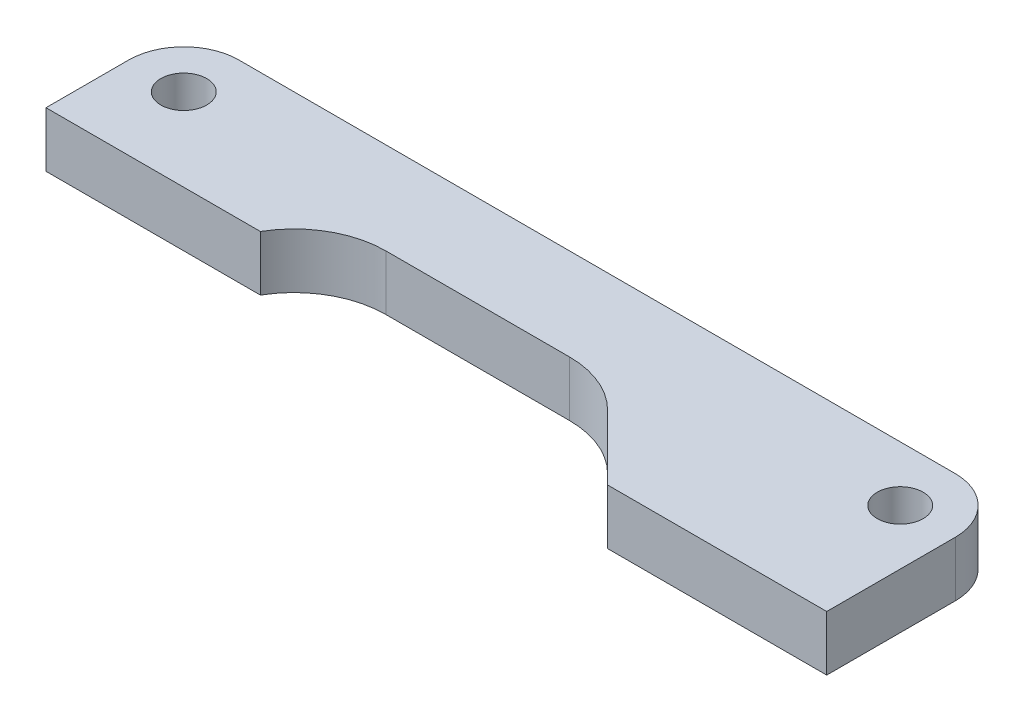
from build123d import *

# Parameters (mm, degrees)
SKETCH1_R      = 2.5
EXTRUDE1_DEPTH = 6


with BuildPart() as part:
    # Sketch1 → Extrude1 (new body)
    with BuildSketch(Plane(origin=(0, 0, 0), x_dir=(1, 0, 0), z_dir=(0, 1, 0))):
        with BuildLine():
            Line((0, 5), (0, 14))
            ThreePointArc((0, 14), (1.757359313, 18.242640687), (6, 20))
            Line((6, 20), (84, 20))
            ThreePointArc((84, 20), (88.242640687, 18.242640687), (90, 14))
            Line((90, 14), (90, 0))
            Line((90, 0), (66.142135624, 0))
            Line((66.142135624, 0), (59.071067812, 7.071067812))
            ThreePointArc((59.071067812, 7.071067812), (55.826834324, 9.238795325), (52, 10))
            Line((52, 10), (32, 10))
            ThreePointArc((32, 10), (27, 8.660254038), (23.339745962, 5))
            Line((23.339745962, 5), (0, 5))
        make_face()
        with Locations(Location((6, 14, 0), (0, 0, 270))):
            Circle(SKETCH1_R, mode=Mode.SUBTRACT)
        with Locations(Location((84, 14, 0), (0, 0, 270))):
            Circle(SKETCH1_R, mode=Mode.SUBTRACT)
    extrude(amount=EXTRUDE1_DEPTH)


solid = part.part
